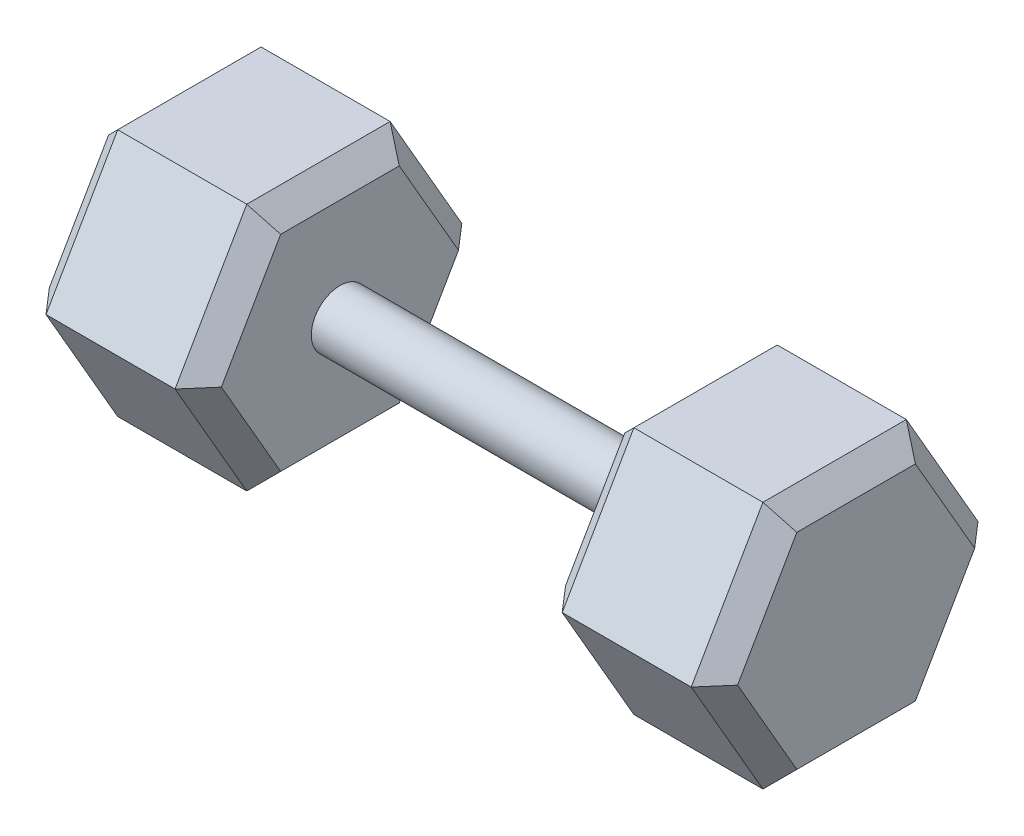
from build123d import *

# Parameters (mm, degrees)
BASE_EXTRUDE_DEPTH  = 76.2
CHAMFER1_SIZE       = 9.525
SKETCH2_R           = 12.691316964
BOSS_EXTRUDE1_DEPTH = 76.2


with BuildPart() as part:
    # Sketch1 → Base-Extrude (new body)
    with BuildSketch(Plane(origin=(0, 0, 0), x_dir=(0, 0, -1), z_dir=(1, 0, 0))):
        Polygon((63.5, 0), (31.75, 54.99261314), (-31.75, 54.99261314), (-63.5, 0), (-31.75, -54.99261314), (31.75, -54.99261314), align=None)
    extrude(amount=BASE_EXTRUDE_DEPTH)

    # Chamfer1
    chamfer1_edges = [part.edges().sort_by_distance(p)[0] for p in [
        (76.2, 54.99261314, 0),
        (76.2, 27.49630657, 47.625),
        (76.2, -27.49630657, 47.625),
        (76.2, -54.99261314, 0),
        (76.2, -27.49630657, -47.625),
        (0, -54.99261314, 0),
        (0, -27.49630657, 47.625),
        (0, 27.49630657, 47.625),
        (0, 54.99261314, 0),
        (76.2, 27.49630657, -47.625),
        (0, 27.49630657, -47.625),
        (0, -27.49630657, -47.625),
    ]]
    chamfer(chamfer1_edges, length=CHAMFER1_SIZE)

    # Sketch2 → Boss-Extrude1 (add)
    with BuildSketch(Plane(origin=(76.2, 0, 0), x_dir=(0, 0, -1), z_dir=(1, 0, 0))):
        with Locations(Location((0, 0, 0), (0, 0, 180))):
            Circle(SKETCH2_R)
    extrude(amount=BOSS_EXTRUDE1_DEPTH)

    # Mirror All1: part across plane


with BuildPart() as part_1:
    add(part.part)
    add(part.part.mirror(Plane(origin=(152.4, 0, 0), x_dir=(0, 0, 1), z_dir=(1, 0, 0))))


solid = part_1.part
